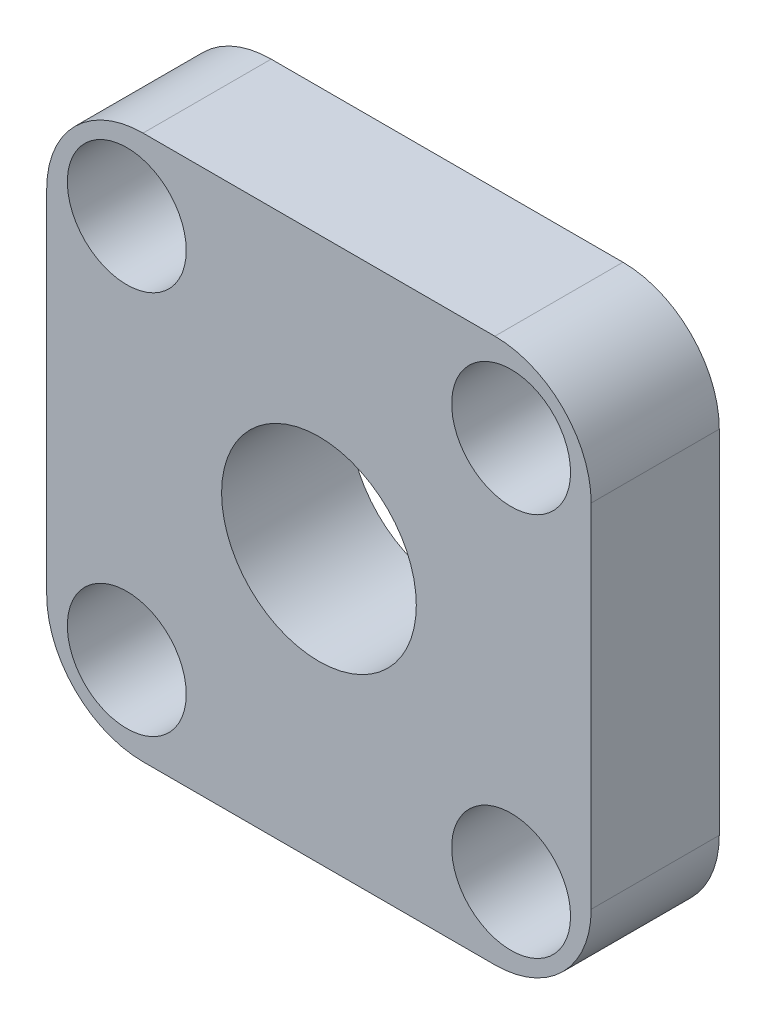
from build123d import *

# Parameters (mm, degrees)
SKETCH1_W                    = 13.49375
SKETCH1_H                    = 13.49375
SKETCH1_R                    = 2.413
BOSS_EXTRUDE1_DEPTH          = 3.175
F_1_8_0_125_DIAMETER_HOLE1_D = 2.9464
FILLET3_R                    = 2.3876


with BuildPart() as part:
    # Sketch1 → Boss-Extrude1 (new body)
    with BuildSketch(Plane.XY):
        Rectangle(SKETCH1_W, SKETCH1_H)
        Circle(SKETCH1_R, mode=Mode.SUBTRACT)
    extrude(amount=BOSS_EXTRUDE1_DEPTH)

    # 1_8 _0.125_ Diameter Hole1 (through all)
    with Locations(Plane.XY.offset(3.175)):
        with Locations((4.7625, 4.7625), (-4.7625, 4.7625), (-4.7625, -4.7625), (4.7625, -4.7625)):
            Hole(F_1_8_0_125_DIAMETER_HOLE1_D / 2)

    # Fillet3
    fillet3_edges = [part.edges().sort_by_distance(p)[0] for p in [
        (-6.746875, 6.746875, 1.5875),
        (6.746875, 6.746875, 1.5875),
        (6.746875, -6.746875, 1.5875),
        (-6.746875, -6.746875, 1.5875),
    ]]
    fillet(fillet3_edges, radius=FILLET3_R)


solid = part.part
